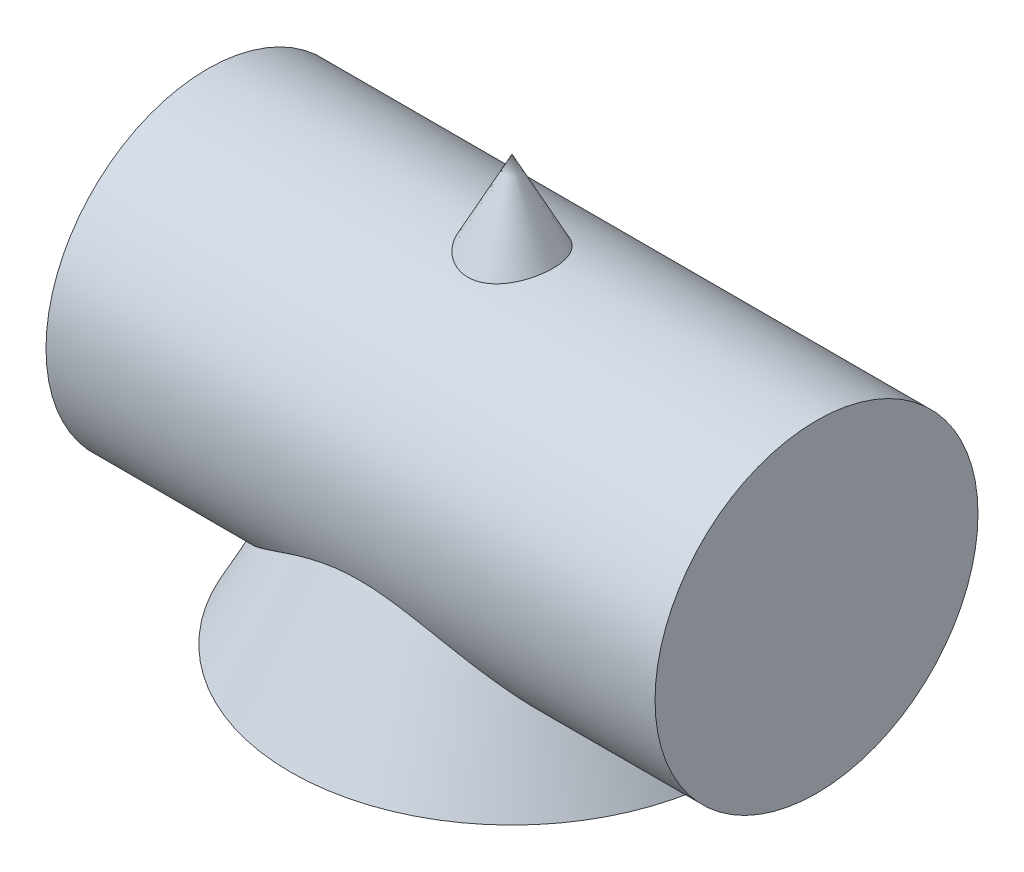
ISO-10303-21;
HEADER;
FILE_DESCRIPTION(('STEP AP214'),'2;1');
FILE_NAME('part.step','',(''),(''),'','','');
FILE_SCHEMA(('AUTOMOTIVE_DESIGN { 1 0 10303 214 1 1 1 1 }'));
ENDSEC;
DATA;
#1=APPLICATION_CONTEXT('core data for automotive mechanical design processes');
#2=APPLICATION_PROTOCOL_DEFINITION('international standard','automotive_design',2000,#1);
#3=PRODUCT_CONTEXT('',#1,'mechanical');
#4=PRODUCT('Part','Part','',(#3));
#5=PRODUCT_RELATED_PRODUCT_CATEGORY('part','',(#4));
#6=PRODUCT_DEFINITION_FORMATION('','',#4);
#7=PRODUCT_DEFINITION_CONTEXT('part definition',#1,'design');
#8=PRODUCT_DEFINITION('design','',#6,#7);
#9=PRODUCT_DEFINITION_SHAPE('','',#8);
#10=(LENGTH_UNIT() NAMED_UNIT(*) SI_UNIT(.MILLI.,.METRE.));
#11=(NAMED_UNIT(*) PLANE_ANGLE_UNIT() SI_UNIT($,.RADIAN.));
#12=(NAMED_UNIT(*) SI_UNIT($,.STERADIAN.) SOLID_ANGLE_UNIT());
#13=UNCERTAINTY_MEASURE_WITH_UNIT(LENGTH_MEASURE(1.E-05),#10,'distance_accuracy_value','');
#14=(GEOMETRIC_REPRESENTATION_CONTEXT(3) GLOBAL_UNCERTAINTY_ASSIGNED_CONTEXT((#13)) GLOBAL_UNIT_ASSIGNED_CONTEXT((#10,
#11,#12)) REPRESENTATION_CONTEXT('',''));
#15=CARTESIAN_POINT('',(0.,0.,0.));
#16=DIRECTION('',(0.,0.,1.));
#17=DIRECTION('',(1.,0.,0.));
#18=AXIS2_PLACEMENT_3D('',#15,#16,#17);
#19=CARTESIAN_POINT('',(0.,46.,0.));
#20=DIRECTION('',(0.,-1.,0.));
#21=DIRECTION('',(0.,0.,-1.));
#22=AXIS2_PLACEMENT_3D('',#19,#20,#21);
#23=CONICAL_SURFACE('',#22,0.,0.480887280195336);
#24=CARTESIAN_POINT('',(0.,0.,0.));
#25=DIRECTION('',(0.,1.,0.));
#26=DIRECTION('',(0.,0.,1.));
#27=AXIS2_PLACEMENT_3D('',#24,#25,#26);
#28=CIRCLE('',#27,24.);
#29=CARTESIAN_POINT('',(0.,0.,24.));
#30=VERTEX_POINT('',#29);
#31=EDGE_CURVE('E11',#30,#30,#28,.T.);
#32=ORIENTED_EDGE('',*,*,#31,.T.);
#33=EDGE_LOOP('',(#32));
#34=FACE_BOUND('',#33,.T.);
#35=CARTESIAN_POINT('',(-19.6333077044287,4.82625422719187,-8.71822816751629));
#36=CARTESIAN_POINT('',(-19.2858806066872,5.08481024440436,-9.16826632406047));
#37=CARTESIAN_POINT('',(-18.918225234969,5.35640265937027,-9.59464858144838));
#38=CARTESIAN_POINT('',(-18.1490876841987,5.9187412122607,-10.4024172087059));
#39=CARTESIAN_POINT('',(-17.7475812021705,6.20950107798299,-10.7837707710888));
#40=CARTESIAN_POINT('',(-16.914963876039,6.80474056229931,-11.5045411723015));
#41=CARTESIAN_POINT('',(-16.4837505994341,7.10926626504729,-11.8438003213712));
#42=CARTESIAN_POINT('',(-15.5969777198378,7.72542721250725,-12.4812350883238));
#43=CARTESIAN_POINT('',(-15.1414222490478,8.03706124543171,-12.7794176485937));
#44=CARTESIAN_POINT('',(-14.3786481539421,8.54820212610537,-13.2354514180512));
#45=CARTESIAN_POINT('',(-14.0778798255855,8.7471793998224,-13.4048393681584));
#46=CARTESIAN_POINT('',(-13.4679475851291,9.1445443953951,-13.7286108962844));
#47=CARTESIAN_POINT('',(-13.1587831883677,9.34293208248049,-13.8829936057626));
#48=CARTESIAN_POINT('',(-12.5322084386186,9.73777820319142,-14.1773577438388));
#49=CARTESIAN_POINT('',(-12.2147936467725,9.93423551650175,-14.3173312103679));
#50=CARTESIAN_POINT('',(-11.572018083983,10.3235686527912,-14.5832864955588));
#51=CARTESIAN_POINT('',(-11.246657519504,10.5164445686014,-14.7092686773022));
#52=CARTESIAN_POINT('',(-10.5884248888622,10.8966523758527,-14.947552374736));
#53=CARTESIAN_POINT('',(-10.2555634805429,11.0839913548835,-15.0598720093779));
#54=CARTESIAN_POINT('',(-9.58177377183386,11.4514617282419,-15.2714583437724));
#55=CARTESIAN_POINT('',(-9.24084501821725,11.6315927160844,-15.3707243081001));
#56=CARTESIAN_POINT('',(-8.55099453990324,11.9822504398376,-15.5565106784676));
#57=CARTESIAN_POINT('',(-8.20207897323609,12.1527842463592,-15.6430405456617));
#58=CARTESIAN_POINT('',(-7.49584762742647,12.4817243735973,-15.8037665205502));
#59=CARTESIAN_POINT('',(-7.13853333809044,12.6401328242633,-15.8779647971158));
#60=CARTESIAN_POINT('',(-6.37595785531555,12.9581785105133,-16.0217481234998));
#61=CARTESIAN_POINT('',(-5.96970498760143,13.1160795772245,-16.0899562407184));
#62=CARTESIAN_POINT('',(-5.1466832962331,13.408385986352,-16.2119008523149));
#63=CARTESIAN_POINT('',(-4.72991582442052,13.5427943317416,-16.2656391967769));
#64=CARTESIAN_POINT('',(-3.88812103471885,13.7823277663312,-16.3586994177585));
#65=CARTESIAN_POINT('',(-3.46313182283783,13.887563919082,-16.3980761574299));
#66=CARTESIAN_POINT('',(-2.60504275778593,14.0641624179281,-16.4628292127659));
#67=CARTESIAN_POINT('',(-2.17194346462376,14.1355270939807,-16.4882064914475));
#68=CARTESIAN_POINT('',(-1.29518446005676,14.2406993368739,-16.5252436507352));
#69=CARTESIAN_POINT('',(-0.851460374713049,14.2740399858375,-16.5367330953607));
#70=CARTESIAN_POINT('',(0.037293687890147,14.2992553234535,-16.5454436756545));
#71=CARTESIAN_POINT('',(0.482323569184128,14.2911329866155,-16.5426658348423));
#72=CARTESIAN_POINT('',(1.37012760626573,14.2339653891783,-16.5228242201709));
#73=CARTESIAN_POINT('',(1.81289673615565,14.1848516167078,-16.5057365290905));
#74=CARTESIAN_POINT('',(2.69178881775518,14.0489318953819,-16.4572146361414));
#75=CARTESIAN_POINT('',(3.12791020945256,13.9621172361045,-16.4257771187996));
#76=CARTESIAN_POINT('',(4.10468130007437,13.7286284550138,-16.3382744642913));
#77=CARTESIAN_POINT('',(4.6426021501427,13.5722100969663,-16.2779032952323));
#78=CARTESIAN_POINT('',(5.70150464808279,13.2184594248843,-16.1337240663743));
#79=CARTESIAN_POINT('',(6.22247909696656,13.0211099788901,-16.0499061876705));
#80=CARTESIAN_POINT('',(7.24923440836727,12.5949617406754,-15.8578140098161));
#81=CARTESIAN_POINT('',(7.75494215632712,12.36603417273,-15.7494383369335));
#82=CARTESIAN_POINT('',(8.74941781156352,11.8859752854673,-15.507573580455));
#83=CARTESIAN_POINT('',(9.23818647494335,11.6348449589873,-15.3740856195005));
#84=CARTESIAN_POINT('',(10.0549021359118,11.1950569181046,-15.1250233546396));
#85=CARTESIAN_POINT('',(10.3870292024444,11.0103105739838,-15.0161251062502));
#86=CARTESIAN_POINT('',(11.0434774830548,10.6352235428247,-14.7851094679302));
#87=CARTESIAN_POINT('',(11.3677981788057,10.4448824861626,-14.6629912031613));
#88=CARTESIAN_POINT('',(12.0087549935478,10.0602654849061,-14.4050452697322));
#89=CARTESIAN_POINT('',(12.3253879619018,9.86598798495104,-14.269212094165));
#90=CARTESIAN_POINT('',(12.9507565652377,9.47509085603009,-13.983380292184));
#91=CARTESIAN_POINT('',(13.2594915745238,9.27847104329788,-13.8333805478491));
#92=CARTESIAN_POINT('',(13.8679322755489,8.88487736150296,-13.5191448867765));
#93=CARTESIAN_POINT('',(14.1676613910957,8.68790613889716,-13.3549511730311));
#94=CARTESIAN_POINT('',(14.7586011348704,8.29438906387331,-13.0114150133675));
#95=CARTESIAN_POINT('',(15.0498106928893,8.09784326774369,-12.8320706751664));
#96=CARTESIAN_POINT('',(15.9094592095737,7.51107659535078,-12.2706837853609));
#97=CARTESIAN_POINT('',(16.4645680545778,7.12330171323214,-11.8649552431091));
#98=CARTESIAN_POINT('',(17.31294962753,6.52094635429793,-11.1661280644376));
#99=CARTESIAN_POINT('',(17.6203274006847,6.30049168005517,-10.8949789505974));
#100=CARTESIAN_POINT('',(18.2181440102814,5.868212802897,-10.3280978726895));
#101=CARTESIAN_POINT('',(18.5085838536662,5.65638808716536,-10.0323673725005));
#102=CARTESIAN_POINT('',(19.0697065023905,5.24435193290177,-9.41584768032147));
#103=CARTESIAN_POINT('',(19.3404104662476,5.044128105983,-9.09508611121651));
#104=CARTESIAN_POINT('',(19.8594221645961,4.65807338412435,-8.42756795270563));
#105=CARTESIAN_POINT('',(20.1077273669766,4.47224411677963,-8.08080843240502));
#106=CARTESIAN_POINT('',(20.5298172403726,4.15489437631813,-7.43532345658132));
#107=CARTESIAN_POINT('',(20.7084276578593,4.02006285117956,-7.14137839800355));
#108=CARTESIAN_POINT('',(21.0469915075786,3.76368546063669,-6.5375516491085));
#109=CARTESIAN_POINT('',(21.2069551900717,3.64213229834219,-6.2276788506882));
#110=CARTESIAN_POINT('',(21.5059560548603,3.4143441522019,-5.59282267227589));
#111=CARTESIAN_POINT('',(21.6450077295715,3.30809856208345,-5.26784996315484));
#112=CARTESIAN_POINT('',(21.8999449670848,3.11291084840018,-4.60389714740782));
#113=CARTESIAN_POINT('',(22.0158343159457,3.02396589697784,-4.26491934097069));
#114=CARTESIAN_POINT('',(22.2061038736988,2.87771038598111,-3.62858041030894));
#115=CARTESIAN_POINT('',(22.2841365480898,2.81763136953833,-3.33294478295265));
#116=CARTESIAN_POINT('',(22.420794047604,2.71231424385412,-2.73462067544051));
#117=CARTESIAN_POINT('',(22.4794208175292,2.6670746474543,-2.43193290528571));
#118=CARTESIAN_POINT('',(22.5762104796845,2.59234047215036,-1.82150832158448));
#119=CARTESIAN_POINT('',(22.614382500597,2.56283886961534,-1.51377382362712));
#120=CARTESIAN_POINT('',(22.669580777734,2.52016678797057,-0.895272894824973));
#121=CARTESIAN_POINT('',(22.6866067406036,2.50699653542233,-0.584506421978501));
#122=CARTESIAN_POINT('',(22.6991857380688,2.4972668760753,0.0382273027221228));
#123=CARTESIAN_POINT('',(22.6947039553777,2.50073440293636,0.350195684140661));
#124=CARTESIAN_POINT('',(22.6642771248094,2.52426576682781,0.972448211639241));
#125=CARTESIAN_POINT('',(22.6383320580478,2.54432961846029,1.28273235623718));
#126=CARTESIAN_POINT('',(22.5654758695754,2.60062854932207,1.89941455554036));
#127=CARTESIAN_POINT('',(22.5185591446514,2.63686795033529,2.20581154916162));
#128=CARTESIAN_POINT('',(22.4046276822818,2.7247751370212,2.81257767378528));
#129=CARTESIAN_POINT('',(22.337612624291,2.77644316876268,3.11294670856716));
#130=CARTESIAN_POINT('',(22.1856883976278,2.8934083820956,3.70181112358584));
#131=CARTESIAN_POINT('',(22.1010383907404,2.95850805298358,3.9904130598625));
#132=CARTESIAN_POINT('',(21.9145860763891,3.10164927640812,4.55868510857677));
#133=CARTESIAN_POINT('',(21.8127843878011,3.17969036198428,4.83835554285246));
#134=CARTESIAN_POINT('',(21.593353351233,3.34755691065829,5.38782775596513));
#135=CARTESIAN_POINT('',(21.4757203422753,3.43738509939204,5.65762723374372));
#136=CARTESIAN_POINT('',(21.2259939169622,3.62762126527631,6.1866200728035));
#137=CARTESIAN_POINT('',(21.093897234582,3.72803163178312,6.44581102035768));
#138=CARTESIAN_POINT('',(20.7435354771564,3.99360854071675,7.08668105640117));
#139=CARTESIAN_POINT('',(20.5165149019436,4.16503936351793,7.46101701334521));
#140=CARTESIAN_POINT('',(20.036134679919,4.52588147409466,8.18320115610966));
#141=CARTESIAN_POINT('',(19.7827637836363,4.7153004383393,8.53103791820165));
#142=CARTESIAN_POINT('',(19.2529715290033,5.10888514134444,9.20086058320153));
#143=CARTESIAN_POINT('',(18.9765109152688,5.31307591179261,9.52280055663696));
#144=CARTESIAN_POINT('',(18.4040497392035,5.73273730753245,10.1407461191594));
#145=CARTESIAN_POINT('',(18.1080493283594,5.94820784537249,10.4367519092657));
#146=CARTESIAN_POINT('',(17.3581702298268,6.48926922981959,11.1348693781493));
#147=CARTESIAN_POINT('',(16.894553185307,6.81972791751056,11.52278962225));
#148=CARTESIAN_POINT('',(15.9366273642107,7.49120926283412,12.2484545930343));
#149=CARTESIAN_POINT('',(15.4423034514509,7.83223708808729,12.586174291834));
#150=CARTESIAN_POINT('',(14.425328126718,8.51882145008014,13.2155227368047));
#151=CARTESIAN_POINT('',(13.9025904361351,8.86438905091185,13.5069992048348));
#152=CARTESIAN_POINT('',(12.8325639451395,9.55184563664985,14.0455156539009));
#153=CARTESIAN_POINT('',(12.2852797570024,9.89373529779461,14.2925639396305));
#154=CARTESIAN_POINT('',(11.4337813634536,10.405569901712,14.6370030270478));
#155=CARTESIAN_POINT('',(11.1381378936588,10.5797470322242,14.7495722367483));
#156=CARTESIAN_POINT('',(10.5403241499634,10.9236304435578,14.9636395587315));
#157=CARTESIAN_POINT('',(10.2381543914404,11.0933370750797,15.0651385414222));
#158=CARTESIAN_POINT('',(9.62701165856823,11.4269322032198,15.2574440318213));
#159=CARTESIAN_POINT('',(9.31803465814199,11.5908170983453,15.3482439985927));
#160=CARTESIAN_POINT('',(8.69334286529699,11.9109715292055,15.5193607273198));
#161=CARTESIAN_POINT('',(8.37762879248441,12.0672418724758,15.5996786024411));
#162=CARTESIAN_POINT('',(7.74075275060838,12.3695466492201,15.7497464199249));
#163=CARTESIAN_POINT('',(7.41962380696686,12.5156262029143,15.8195447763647));
#164=CARTESIAN_POINT('',(6.77039487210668,12.7961453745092,15.9492440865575));
#165=CARTESIAN_POINT('',(6.44229443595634,12.9305842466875,16.0091444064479));
#166=CARTESIAN_POINT('',(5.44799371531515,13.3124728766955,16.1741668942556));
#167=CARTESIAN_POINT('',(4.77081535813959,13.5389744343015,16.2648401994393));
#168=CARTESIAN_POINT('',(3.68440720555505,13.83338247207,16.3779183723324));
#169=CARTESIAN_POINT('',(3.28356329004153,13.9277856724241,16.4129609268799));
#170=CARTESIAN_POINT('',(2.4749649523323,14.086129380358,16.470678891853));
#171=CARTESIAN_POINT('',(2.06721183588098,14.1500755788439,16.4933566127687));
#172=CARTESIAN_POINT('',(1.24829368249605,14.2439234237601,16.5263456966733));
#173=CARTESIAN_POINT('',(0.837139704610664,14.2739096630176,16.5366877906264));
#174=CARTESIAN_POINT('',(0.0136279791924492,14.2983237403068,16.5451221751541));
#175=CARTESIAN_POINT('',(-0.398729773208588,14.2927514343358,16.5432144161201));
#176=CARTESIAN_POINT('',(-1.22074052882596,14.2464172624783,16.5271551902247));
#177=CARTESIAN_POINT('',(-1.63039597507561,14.2056934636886,16.513016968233));
#178=CARTESIAN_POINT('',(-2.44445045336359,14.091489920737,16.4724962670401));
#179=CARTESIAN_POINT('',(-2.84884916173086,14.0180081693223,16.4461130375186));
#180=CARTESIAN_POINT('',(-3.65144991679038,13.8417940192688,16.3809428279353));
#181=CARTESIAN_POINT('',(-4.04962883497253,13.7389715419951,16.342117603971));
#182=CARTESIAN_POINT('',(-4.83724965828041,13.5085684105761,16.251973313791));
#183=CARTESIAN_POINT('',(-5.22669034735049,13.380984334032,16.2006525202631));
#184=CARTESIAN_POINT('',(-6.25342360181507,13.0134179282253,16.0467875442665));
#185=CARTESIAN_POINT('',(-6.88258221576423,12.7552678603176,15.9329216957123));
#186=CARTESIAN_POINT('',(-7.80698487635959,12.3388568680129,15.7346977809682));
#187=CARTESIAN_POINT('',(-8.11203585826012,12.1951141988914,15.6640124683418));
#188=CARTESIAN_POINT('',(-8.71589052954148,11.8996298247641,15.5132682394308));
#189=CARTESIAN_POINT('',(-9.01469448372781,11.7478884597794,15.4332097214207));
#190=CARTESIAN_POINT('',(-9.90372860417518,11.2821909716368,15.1781143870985));
#191=CARTESIAN_POINT('',(-10.4848071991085,10.9585803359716,14.9885357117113));
#192=CARTESIAN_POINT('',(-11.6229104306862,10.2964728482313,14.5686456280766));
#193=CARTESIAN_POINT('',(-12.1799415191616,9.9579800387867,14.3383452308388));
#194=CARTESIAN_POINT('',(-13.3076760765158,9.25064586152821,13.8169319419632));
#195=CARTESIAN_POINT('',(-13.8766526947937,8.8813267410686,13.5227111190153));
#196=CARTESIAN_POINT('',(-14.9851167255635,8.14389446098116,12.88106776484));
#197=CARTESIAN_POINT('',(-15.5245933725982,7.77578178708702,12.5336259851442));
#198=CARTESIAN_POINT('',(-16.567614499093,7.05093483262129,11.7831544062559));
#199=CARTESIAN_POINT('',(-17.0712950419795,6.69416067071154,11.3803543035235));
#200=CARTESIAN_POINT('',(-18.0379746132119,6.00000854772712,10.5146589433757));
#201=CARTESIAN_POINT('',(-18.5010124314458,5.66261220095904,10.0518220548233));
#202=CARTESIAN_POINT('',(-19.4133526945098,4.99100627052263,9.02151263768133));
#203=CARTESIAN_POINT('',(-19.8584818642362,4.65928328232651,8.44859374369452));
#204=CARTESIAN_POINT('',(-20.4693860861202,4.20046161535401,7.53267752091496));
#205=CARTESIAN_POINT('',(-20.6635347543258,4.05399774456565,7.21799288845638));
#206=CARTESIAN_POINT('',(-21.0304802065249,3.77623961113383,6.56991382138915));
#207=CARTESIAN_POINT('',(-21.2032798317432,3.64494333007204,6.23652188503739));
#208=CARTESIAN_POINT('',(-21.4993713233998,3.41935083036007,5.60588244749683));
#209=CARTESIAN_POINT('',(-21.6261749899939,3.32248332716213,5.31120060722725));
#210=CARTESIAN_POINT('',(-21.8608199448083,3.14289282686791,4.71022661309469));
#211=CARTESIAN_POINT('',(-21.9686653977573,3.06016672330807,4.40393702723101));
#212=CARTESIAN_POINT('',(-22.1636372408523,2.91038598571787,3.7812152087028));
#213=CARTESIAN_POINT('',(-22.2507724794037,2.84332465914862,3.46478737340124));
#214=CARTESIAN_POINT('',(-22.402787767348,2.72620474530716,2.82351085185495));
#215=CARTESIAN_POINT('',(-22.4676677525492,2.67614620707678,2.49866214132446));
#216=CARTESIAN_POINT('',(-22.5741806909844,2.59391067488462,1.84081420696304));
#217=CARTESIAN_POINT('',(-22.6156669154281,2.56184655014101,1.50777691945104));
#218=CARTESIAN_POINT('',(-22.6738472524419,2.51686781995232,0.838243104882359));
#219=CARTESIAN_POINT('',(-22.6905413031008,2.50395326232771,0.501746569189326));
#220=CARTESIAN_POINT('',(-22.6987509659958,2.49760308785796,-0.171682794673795));
#221=CARTESIAN_POINT('',(-22.6902706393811,2.50416432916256,-0.508615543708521));
#222=CARTESIAN_POINT('',(-22.6483356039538,2.53659240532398,-1.17996679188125));
#223=CARTESIAN_POINT('',(-22.6148822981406,2.56245815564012,-1.51438543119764));
#224=CARTESIAN_POINT('',(-22.5282806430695,2.62935537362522,-2.14501802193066));
#225=CARTESIAN_POINT('',(-22.4774096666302,2.6686321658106,-2.44173693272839));
#226=CARTESIAN_POINT('',(-22.3569015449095,2.76156908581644,-3.02900474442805));
#227=CARTESIAN_POINT('',(-22.2872660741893,2.81522793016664,-3.31955419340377));
#228=CARTESIAN_POINT('',(-22.1303196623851,2.9359896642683,-3.89299762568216));
#229=CARTESIAN_POINT('',(-22.0430064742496,3.00309426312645,-4.17589063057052));
#230=CARTESIAN_POINT('',(-21.8519472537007,3.14967133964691,-4.73279746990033));
#231=CARTESIAN_POINT('',(-21.7481984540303,3.2291458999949,-5.00680979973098));
#232=CARTESIAN_POINT('',(-21.5062286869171,3.41411013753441,-5.59177620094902));
#233=CARTESIAN_POINT('',(-21.3651501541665,3.52172078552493,-5.90088061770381));
#234=CARTESIAN_POINT('',(-21.0642901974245,3.75052408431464,-6.50452321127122));
#235=CARTESIAN_POINT('',(-20.9045069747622,3.87171804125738,-6.79905998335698));
#236=CARTESIAN_POINT('',(-20.3998673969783,4.2531517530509,-7.66034706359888));
#237=CARTESIAN_POINT('',(-20.0297572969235,4.53121556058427,-8.20468893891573));
#238=CARTESIAN_POINT('',(-19.6333077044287,4.82625422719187,-8.71822816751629));
#239=B_SPLINE_CURVE_WITH_KNOTS('',3,(#35,#36,#37,#38,#39,#40,#41,#42,#43,#44,#45,#46,#47,#48,
#49,#50,#51,#52,#53,#54,#55,#56,#57,#58,#59,#60,#61,#62,#63,#64,#65,#66,#67,#68,#69,#70,#71,#72,
#73,#74,#75,#76,#77,#78,#79,#80,#81,#82,#83,#84,#85,#86,#87,#88,#89,#90,#91,#92,#93,#94,#95,#96,
#97,#98,#99,#100,#101,#102,#103,#104,#105,#106,#107,#108,#109,#110,#111,#112,#113,#114,#115,
#116,#117,#118,#119,#120,#121,#122,#123,#124,#125,#126,#127,#128,#129,#130,#131,#132,#133,#134,
#135,#136,#137,#138,#139,#140,#141,#142,#143,#144,#145,#146,#147,#148,#149,#150,#151,#152,#153,
#154,#155,#156,#157,#158,#159,#160,#161,#162,#163,#164,#165,#166,#167,#168,#169,#170,#171,#172,
#173,#174,#175,#176,#177,#178,#179,#180,#181,#182,#183,#184,#185,#186,#187,#188,#189,#190,#191,
#192,#193,#194,#195,#196,#197,#198,#199,#200,#201,#202,#203,#204,#205,#206,#207,#208,#209,#210,
#211,#212,#213,#214,#215,#216,#217,#218,#219,#220,#221,#222,#223,#224,#225,#226,#227,#228,#229,
#230,#231,#232,#233,#234,#235,#236,#237,#238),.UNSPECIFIED.,.T.,.F.,(4,2,2,2,2,2,2,2,2,2,2,2,2,
2,2,2,2,2,2,2,2,2,2,2,2,2,2,2,2,2,2,2,2,2,2,2,2,2,2,2,2,2,2,2,2,2,2,2,2,2,2,2,2,2,2,2,2,2,2,2,2,
2,2,2,2,2,2,2,2,2,2,2,2,2,2,2,2,2,2,2,2,2,2,2,2,2,2,2,2,2,2,2,2,2,2,2,2,2,2,2,2,4),(0.,
1.87237922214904,3.74611433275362,5.6266693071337,7.50690605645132,8.70185931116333,
9.89688169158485,11.0925608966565,12.2882090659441,13.4822538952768,14.6763659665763,
15.8695864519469,17.0625968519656,18.3852167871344,19.7076675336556,21.0250120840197,
22.3422660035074,23.6755267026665,25.0086917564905,26.3440894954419,27.6797959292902,
29.3673668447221,31.0556455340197,32.7510246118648,34.4463279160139,35.6320534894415,
36.8178575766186,38.0041397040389,39.1905155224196,40.3734778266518,41.5565880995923,
43.9202835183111,45.3156718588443,46.7109771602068,48.1047638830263,49.4987079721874,
50.6060836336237,51.7128476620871,52.8188411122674,53.9246536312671,54.858506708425,
55.792266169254,56.7256085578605,57.658963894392,58.5938306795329,59.5286982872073,
60.4638158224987,61.3989482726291,62.3212014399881,63.2434213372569,64.1658548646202,
65.0884971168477,66.4968174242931,67.905741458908,69.3171115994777,70.7284707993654,
72.7921450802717,74.8568447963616,76.928208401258,78.9991844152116,80.0823635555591,
81.1654574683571,82.2492101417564,83.332847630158,84.411334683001,85.4898907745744,
87.6436741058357,88.8824589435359,90.1210122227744,91.3564734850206,92.5919397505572,
93.8260697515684,95.0602753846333,96.2983116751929,97.5365192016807,99.6014911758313,
100.634952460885,101.668369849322,103.741158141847,105.813386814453,108.029195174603,
110.245806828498,112.453484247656,114.659031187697,117.043791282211,118.235867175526,
119.427784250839,120.432178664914,121.436352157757,122.440095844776,123.443842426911,
124.453816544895,125.463793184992,126.473606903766,127.483363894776,128.393166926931,
129.302888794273,130.212726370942,131.122717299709,132.190758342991,133.258902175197,
135.395476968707),.UNSPECIFIED.);
#240=CARTESIAN_POINT('',(-19.6333077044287,4.82625422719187,-8.71822816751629));
#241=VERTEX_POINT('',#240);
#242=EDGE_CURVE('E47',#241,#241,#239,.T.);
#243=ORIENTED_EDGE('',*,*,#242,.T.);
#244=EDGE_LOOP('',(#243));
#245=FACE_BOUND('',#244,.T.);
#246=ADVANCED_FACE('F43',(#34,#245),#23,.T.);
#247=CARTESIAN_POINT('',(0.,0.,0.));
#248=DIRECTION('',(0.,-1.,0.));
#249=DIRECTION('',(0.,0.,-1.));
#250=AXIS2_PLACEMENT_3D('',#247,#248,#249);
#251=PLANE('',#250);
#252=ORIENTED_EDGE('',*,*,#31,.F.);
#253=EDGE_LOOP('',(#252));
#254=FACE_BOUND('',#253,.T.);
#255=ADVANCED_FACE('F45',(#254),#251,.T.);
#256=CARTESIAN_POINT('',(33.,20.,0.));
#257=DIRECTION('',(-1.,0.,0.));
#258=DIRECTION('',(0.,0.,1.));
#259=AXIS2_PLACEMENT_3D('',#256,#257,#258);
#260=CYLINDRICAL_SURFACE('',#259,17.5);
#261=ORIENTED_EDGE('',*,*,#242,.F.);
#262=EDGE_LOOP('',(#261));
#263=FACE_BOUND('',#262,.T.);
#264=CARTESIAN_POINT('',(-1.64588823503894,36.9279452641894,-4.43786763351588));
#265=CARTESIAN_POINT('',(-1.77170293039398,36.9422665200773,-4.38323854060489));
#266=CARTESIAN_POINT('',(-1.89472865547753,36.9578901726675,-4.32257218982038));
#267=CARTESIAN_POINT('',(-2.13433784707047,36.9911389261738,-4.18997286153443));
#268=CARTESIAN_POINT('',(-2.25091799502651,37.008765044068,-4.11803415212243));
#269=CARTESIAN_POINT('',(-2.47694619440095,37.0453990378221,-3.96366793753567));
#270=CARTESIAN_POINT('',(-2.58638292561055,37.06440901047,-3.88122436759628));
#271=CARTESIAN_POINT('',(-2.7972805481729,37.1031417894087,-3.70682362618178));
#272=CARTESIAN_POINT('',(-2.89873810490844,37.1228648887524,-3.61486251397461));
#273=CARTESIAN_POINT('',(-3.17211709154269,37.1784603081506,-3.34397114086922));
#274=CARTESIAN_POINT('',(-3.33432540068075,37.2144357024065,-3.15507866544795));
#275=CARTESIAN_POINT('',(-3.62753400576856,37.283086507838,-2.75431736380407));
#276=CARTESIAN_POINT('',(-3.75855424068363,37.3157640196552,-2.54246334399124));
#277=CARTESIAN_POINT('',(-3.99722821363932,37.377429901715,-2.08167331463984));
#278=CARTESIAN_POINT('',(-4.10191200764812,37.4058610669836,-1.83111525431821));
#279=CARTESIAN_POINT('',(-4.26978052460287,37.4524065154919,-1.31549898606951));
#280=CARTESIAN_POINT('',(-4.33295233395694,37.4705175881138,-1.05043629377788));
#281=CARTESIAN_POINT('',(-4.41698376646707,37.4947577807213,-0.508261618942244));
#282=CARTESIAN_POINT('',(-4.43706825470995,37.5006673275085,-0.231019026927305));
#283=CARTESIAN_POINT('',(-4.43208298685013,37.4992117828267,0.323009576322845));
#284=CARTESIAN_POINT('',(-4.40701465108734,37.4918471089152,0.599795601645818));
#285=CARTESIAN_POINT('',(-4.31257610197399,37.464686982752,1.14397191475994));
#286=CARTESIAN_POINT('',(-4.24337530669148,37.444939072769,1.41139402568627));
#287=CARTESIAN_POINT('',(-4.06252276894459,37.3951496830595,1.93049398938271));
#288=CARTESIAN_POINT('',(-3.95086555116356,37.3651068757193,2.18216980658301));
#289=CARTESIAN_POINT('',(-3.68705113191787,37.2978112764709,2.66366413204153));
#290=CARTESIAN_POINT('',(-3.53472825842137,37.2605291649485,2.89338788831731));
#291=CARTESIAN_POINT('',(-3.19293544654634,37.1830173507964,3.32288940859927));
#292=CARTESIAN_POINT('',(-3.00346157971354,37.1427873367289,3.52266400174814));
#293=CARTESIAN_POINT('',(-2.59558327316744,37.065075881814,3.88153108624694));
#294=CARTESIAN_POINT('',(-2.37784030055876,37.0275553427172,4.04136362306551));
#295=CARTESIAN_POINT('',(-1.91585021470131,36.9593685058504,4.31860092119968));
#296=CARTESIAN_POINT('',(-1.67162363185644,36.9286969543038,4.43603824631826));
#297=CARTESIAN_POINT('',(-1.18582831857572,36.8809583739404,4.61422488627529));
#298=CARTESIAN_POINT('',(-0.945819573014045,36.8629519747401,4.67896428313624));
#299=CARTESIAN_POINT('',(-0.457519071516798,36.8391089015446,4.76408038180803));
#300=CARTESIAN_POINT('',(-0.209233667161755,36.833263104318,4.78449034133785));
#301=CARTESIAN_POINT('',(0.263452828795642,36.8345298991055,4.78001335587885));
#302=CARTESIAN_POINT('',(0.487907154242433,36.8404770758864,4.75920041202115));
#303=CARTESIAN_POINT('',(0.929901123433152,36.8622944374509,4.68130764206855));
#304=CARTESIAN_POINT('',(1.14744069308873,36.8781647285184,4.62422742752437));
#305=CARTESIAN_POINT('',(1.56905990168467,36.917882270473,4.47671800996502));
#306=CARTESIAN_POINT('',(1.77318897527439,36.9416979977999,4.3864204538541));
#307=CARTESIAN_POINT('',(2.16458414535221,36.9948029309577,4.17593346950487));
#308=CARTESIAN_POINT('',(2.35184532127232,37.0240937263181,4.05573535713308));
#309=CARTESIAN_POINT('',(2.7210453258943,37.0879576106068,3.77804247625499));
#310=CARTESIAN_POINT('',(2.90122651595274,37.1227676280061,3.618267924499));
#311=CARTESIAN_POINT('',(3.23479395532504,37.1921441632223,3.27280084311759));
#312=CARTESIAN_POINT('',(3.38816878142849,37.2267105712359,3.08709732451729));
#313=CARTESIAN_POINT('',(3.67860262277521,37.2955454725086,2.67607589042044));
#314=CARTESIAN_POINT('',(3.81280440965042,37.3294852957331,2.44867849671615));
#315=CARTESIAN_POINT('',(4.04356463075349,37.3898842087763,1.97459870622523));
#316=CARTESIAN_POINT('',(4.14011528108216,37.4163417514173,1.72791233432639));
#317=CARTESIAN_POINT('',(4.29670157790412,37.4600466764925,1.21107285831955));
#318=CARTESIAN_POINT('',(4.35505213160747,37.4768653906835,0.940370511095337));
#319=CARTESIAN_POINT('',(4.42717559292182,37.4977417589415,0.39261663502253));
#320=CARTESIAN_POINT('',(4.44094882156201,37.5017995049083,0.115565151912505));
#321=CARTESIAN_POINT('',(4.42356504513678,37.4967257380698,-0.43686071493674));
#322=CARTESIAN_POINT('',(4.39243128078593,37.4876010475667,-0.712235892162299));
#323=CARTESIAN_POINT('',(4.28608839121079,37.4571453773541,-1.2536474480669));
#324=CARTESIAN_POINT('',(4.21087626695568,37.4358135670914,-1.5196831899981));
#325=CARTESIAN_POINT('',(4.01811467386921,37.3831903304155,-2.03516809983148));
#326=CARTESIAN_POINT('',(3.90052930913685,37.3518904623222,-2.28460299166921));
#327=CARTESIAN_POINT('',(3.62565790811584,37.2827194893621,-2.75958113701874));
#328=CARTESIAN_POINT('',(3.46836454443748,37.244847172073,-2.98511997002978));
#329=CARTESIAN_POINT('',(3.11758197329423,37.1668758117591,-3.40497561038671));
#330=CARTESIAN_POINT('',(2.92418446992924,37.1267825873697,-3.59936925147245));
#331=CARTESIAN_POINT('',(2.61024976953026,37.0686514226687,-3.86254870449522));
#332=CARTESIAN_POINT('',(2.50157266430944,37.0496003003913,-3.94557374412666));
#333=CARTESIAN_POINT('',(2.27688600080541,37.0128067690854,-4.10131538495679));
#334=CARTESIAN_POINT('',(2.16088040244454,36.9950636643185,-4.17403748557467));
#335=CARTESIAN_POINT('',(1.9290703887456,36.9624754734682,-4.30449717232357));
#336=CARTESIAN_POINT('',(1.81362700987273,36.9475231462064,-4.36285032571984));
#337=CARTESIAN_POINT('',(1.57773889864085,36.919872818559,-4.46888169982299));
#338=CARTESIAN_POINT('',(1.45729682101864,36.9071736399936,-4.51656550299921));
#339=CARTESIAN_POINT('',(1.21231374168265,36.8844944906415,-4.60062512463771));
#340=CARTESIAN_POINT('',(1.08777431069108,36.8745134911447,-4.63700522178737));
#341=CARTESIAN_POINT('',(0.835675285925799,36.857649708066,-4.69793805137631));
#342=CARTESIAN_POINT('',(0.70811607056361,36.8507665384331,-4.72249225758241));
#343=CARTESIAN_POINT('',(0.349284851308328,36.8362950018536,-4.77394251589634));
#344=CARTESIAN_POINT('',(0.115761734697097,36.8324528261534,-4.78733742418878));
#345=CARTESIAN_POINT('',(-0.349727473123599,36.8362522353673,-4.7739543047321));
#346=CARTESIAN_POINT('',(-0.581695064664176,36.84388040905,-4.74722319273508));
#347=CARTESIAN_POINT('',(-0.953151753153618,36.8647880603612,-4.67222984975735));
#348=CARTESIAN_POINT('',(-1.09526802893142,36.8749561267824,-4.63550632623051));
#349=CARTESIAN_POINT('',(-1.37460779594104,36.8989049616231,-4.54742932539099));
#350=CARTESIAN_POINT('',(-1.51183119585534,36.9126857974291,-4.49607557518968));
#351=CARTESIAN_POINT('',(-1.64588823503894,36.9279452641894,-4.43786763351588));
#352=B_SPLINE_CURVE_WITH_KNOTS('',3,(#264,#265,#266,#267,#268,#269,#270,#271,#272,#273,#274,
#275,#276,#277,#278,#279,#280,#281,#282,#283,#284,#285,#286,#287,#288,#289,#290,#291,#292,#293,
#294,#295,#296,#297,#298,#299,#300,#301,#302,#303,#304,#305,#306,#307,#308,#309,#310,#311,#312,
#313,#314,#315,#316,#317,#318,#319,#320,#321,#322,#323,#324,#325,#326,#327,#328,#329,#330,#331,
#332,#333,#334,#335,#336,#337,#338,#339,#340,#341,#342,#343,#344,#345,#346,#347,#348,#349,#350,
#351),.UNSPECIFIED.,.T.,.F.,(4,2,2,2,2,2,2,2,2,2,2,2,2,2,2,2,2,2,2,2,2,2,2,2,2,2,2,2,2,2,2,2,2,
2,2,2,2,2,2,2,2,2,2,4),(0.,0.413540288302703,0.827291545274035,1.2416833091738,1.65624734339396,
2.40758833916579,3.15844769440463,3.97374019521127,4.78928619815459,5.61938483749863,
6.44945736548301,7.27636239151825,8.1033740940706,8.93380786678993,9.76432949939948,
10.5780801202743,11.391204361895,12.1347675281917,12.8777726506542,13.5509991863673,
14.2242329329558,14.8948267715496,15.565615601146,16.2925542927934,17.019802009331,
17.8148995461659,18.6101613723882,19.4384879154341,20.2668084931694,21.0947005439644,
21.9226489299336,22.7513003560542,23.5801048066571,24.4068320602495,24.8206015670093,
25.2341493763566,25.624265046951,26.0141761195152,26.4039394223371,26.7936541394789,
27.4915311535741,28.1885928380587,28.6292166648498,29.0698487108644),.UNSPECIFIED.);
#353=CARTESIAN_POINT('',(-1.64588823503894,36.9279452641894,-4.43786763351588));
#354=VERTEX_POINT('',#353);
#355=EDGE_CURVE('E65',#354,#354,#352,.T.);
#356=ORIENTED_EDGE('',*,*,#355,.F.);
#357=EDGE_LOOP('',(#356));
#358=FACE_BOUND('',#357,.T.);
#359=CARTESIAN_POINT('',(33.,20.,0.));
#360=DIRECTION('',(1.,0.,0.));
#361=DIRECTION('',(0.,0.,-1.));
#362=AXIS2_PLACEMENT_3D('',#359,#360,#361);
#363=CIRCLE('',#362,17.5);
#364=CARTESIAN_POINT('',(33.,20.,-17.5));
#365=VERTEX_POINT('',#364);
#366=EDGE_CURVE('E68',#365,#365,#363,.T.);
#367=ORIENTED_EDGE('',*,*,#366,.F.);
#368=EDGE_LOOP('',(#367));
#369=FACE_BOUND('',#368,.T.);
#370=CARTESIAN_POINT('',(-33.,20.,0.));
#371=DIRECTION('',(1.,0.,0.));
#372=DIRECTION('',(0.,0.,-1.));
#373=AXIS2_PLACEMENT_3D('',#370,#371,#372);
#374=CIRCLE('',#373,17.5);
#375=CARTESIAN_POINT('',(-33.,20.,-17.5));
#376=VERTEX_POINT('',#375);
#377=EDGE_CURVE('E73',#376,#376,#374,.T.);
#378=ORIENTED_EDGE('',*,*,#377,.T.);
#379=EDGE_LOOP('',(#378));
#380=FACE_BOUND('',#379,.T.);
#381=ADVANCED_FACE('F79',(#263,#358,#369,#380),#260,.T.);
#382=CARTESIAN_POINT('',(33.,20.,0.));
#383=DIRECTION('',(1.,0.,0.));
#384=DIRECTION('',(0.,0.,-1.));
#385=AXIS2_PLACEMENT_3D('',#382,#383,#384);
#386=PLANE('',#385);
#387=ORIENTED_EDGE('',*,*,#366,.T.);
#388=EDGE_LOOP('',(#387));
#389=FACE_BOUND('',#388,.T.);
#390=ADVANCED_FACE('F83',(#389),#386,.T.);
#391=CARTESIAN_POINT('',(-33.,20.,0.));
#392=DIRECTION('',(1.,0.,0.));
#393=DIRECTION('',(0.,0.,-1.));
#394=AXIS2_PLACEMENT_3D('',#391,#392,#393);
#395=PLANE('',#394);
#396=ORIENTED_EDGE('',*,*,#377,.F.);
#397=EDGE_LOOP('',(#396));
#398=FACE_BOUND('',#397,.T.);
#399=ADVANCED_FACE('F62',(#398),#395,.F.);
#400=CARTESIAN_POINT('',(0.,46.,0.));
#401=VERTEX_POINT('',#400);
#402=VERTEX_LOOP('',#401);
#403=FACE_BOUND('',#402,.T.);
#404=ORIENTED_EDGE('',*,*,#355,.T.);
#405=EDGE_LOOP('',(#404));
#406=FACE_BOUND('',#405,.T.);
#407=ADVANCED_FACE('F59',(#403,#406),#23,.T.);
#408=CLOSED_SHELL('',(#246,#255,#381,#390,#399,#407));
#409=MANIFOLD_SOLID_BREP('B2',#408);
#410=ADVANCED_BREP_SHAPE_REPRESENTATION('',(#18,#409),#14);
#411=SHAPE_DEFINITION_REPRESENTATION(#9,#410);
ENDSEC;
END-ISO-10303-21;
